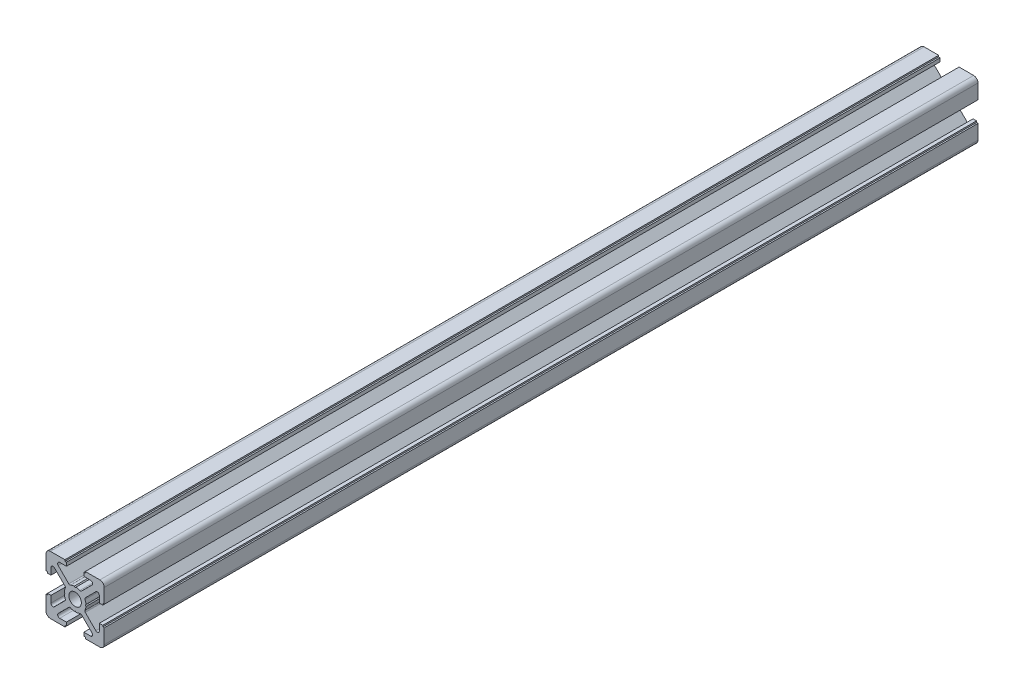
from build123d import *

# Parameters (mm, degrees)
SKETCH1_R           = 2.15
BOSS_EXTRUDE1_DEPTH = 300


with BuildPart() as part:
    # Sketch1 → Boss-Extrude1 (new body)
    with BuildSketch(Plane.XY.offset(308)):
        with BuildLine():
            Line((-3.499999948, -10), (-3.499999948, -9.5))
            Line((-3.499999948, -9.5), (-2.999999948, -9.5))
            Line((-2.999999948, -9.5), (-2.999999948, -8.299999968))
            Line((-2.999999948, -8.299999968), (-5.299390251, -8.299999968))
            ThreePointArc((-5.299390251, -8.299999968), (-5.946105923, -7.867878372), (-5.794365, -7.105025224))
            Line((-5.794365, -7.105025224), (-2.175465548, -3.48612574))
            ThreePointArc((-2.175465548, -3.48612574), (-1.907085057, -3.346986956), (-1.607569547, -3.387952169))
            ThreePointArc((-1.607569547, -3.387952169), (-0.96970891, -3.622452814), (-0.299999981, -3.73798071))
            Line((-0.299999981, -3.73798071), (1.9e-08, -3.449999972))
            Line((1.9e-08, -3.449999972), (0.300000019, -3.737980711))
            ThreePointArc((0.300000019, -3.737980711), (0.969708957, -3.622452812), (1.607569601, -3.387952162))
            ThreePointArc((1.607569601, -3.387952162), (1.90708511, -3.346986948), (2.175465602, -3.48612573))
            Line((2.175465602, -3.48612573), (5.794365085, -7.105025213))
            ThreePointArc((5.794365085, -7.105025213), (5.946106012, -7.867878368), (5.299390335, -8.299999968))
            Line((5.299390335, -8.299999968), (2.999999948, -8.299999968))
            Line((2.999999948, -8.299999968), (2.999999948, -9.5))
            Line((2.999999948, -9.5), (3.499999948, -9.5))
            Line((3.499999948, -9.5), (3.499999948, -10))
            Line((3.499999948, -10), (8.499999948, -10))
            ThreePointArc((8.499999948, -10), (9.56066012, -9.560660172), (9.999999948, -8.5))
            Line((9.999999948, -8.5), (9.999999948, -3.5))
            Line((9.999999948, -3.5), (9.499999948, -3.5))
            Line((9.499999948, -3.5), (9.499999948, -3))
            Line((9.499999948, -3), (8.299999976, -3))
            Line((8.299999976, -3), (8.299999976, -5.299390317))
            ThreePointArc((8.299999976, -5.299390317), (7.867878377, -5.94610599), (7.105025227, -5.794365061))
            Line((7.105025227, -5.794365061), (3.486125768, -2.17546557))
            ThreePointArc((3.486125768, -2.17546557), (3.346986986, -1.907085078), (3.387952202, -1.607569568))
            ThreePointArc((3.387952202, -1.607569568), (3.622452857, -0.969708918), (3.737980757, -0.299999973))
            Line((3.737980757, -0.299999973), (3.450000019, 2.8e-08))
            Line((3.450000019, 2.8e-08), (3.737980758, 0.300000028))
            ThreePointArc((3.737980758, 0.300000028), (3.622452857, 0.969708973), (3.387952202, 1.607569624))
            ThreePointArc((3.387952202, 1.607569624), (3.346986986, 1.907085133), (3.486125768, 2.175465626))
            Line((3.486125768, 2.175465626), (7.105025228, 5.794365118))
            ThreePointArc((7.105025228, 5.794365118), (7.867878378, 5.946106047), (8.299999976, 5.299390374))
            Line((8.299999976, 5.299390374), (8.299999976, 3))
            Line((8.299999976, 3), (9.499999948, 3))
            Line((9.499999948, 3), (9.499999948, 3.5))
            Line((9.499999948, 3.5), (9.999999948, 3.5))
            Line((9.999999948, 3.5), (9.999999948, 8.5))
            ThreePointArc((9.999999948, 8.5), (9.56066012, 9.560660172), (8.499999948, 10))
            Line((8.499999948, 10), (3.499999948, 10))
            Line((3.499999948, 10), (3.499999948, 9.5))
            Line((3.499999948, 9.5), (2.999999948, 9.5))
            Line((2.999999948, 9.5), (2.999999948, 8.300000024))
            Line((2.999999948, 8.300000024), (5.299390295, 8.300000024))
            ThreePointArc((5.299390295, 8.300000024), (5.946105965, 7.86787843), (5.794365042, 7.105025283))
            Line((5.794365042, 7.105025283), (2.175465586, 3.486125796))
            ThreePointArc((2.175465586, 3.486125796), (1.907085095, 3.346987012), (1.607569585, 3.387952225))
            ThreePointArc((1.607569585, 3.387952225), (0.969708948, 3.62245287), (0.300000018, 3.737980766))
            Line((0.300000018, 3.737980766), (1.9e-08, 3.450000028))
            Line((1.9e-08, 3.450000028), (-0.299999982, 3.737980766))
            ThreePointArc((-0.299999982, 3.737980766), (-0.969708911, 3.62245287), (-1.607569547, 3.387952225))
            ThreePointArc((-1.607569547, 3.387952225), (-1.907085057, 3.346987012), (-2.175465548, 3.486125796))
            Line((-2.175465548, 3.486125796), (-5.794365, 7.105025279))
            ThreePointArc((-5.794365, 7.105025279), (-5.946105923, 7.867878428), (-5.299390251, 8.300000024))
            Line((-5.299390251, 8.300000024), (-2.999999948, 8.300000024))
            Line((-2.999999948, 8.300000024), (-2.999999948, 9.5))
            Line((-2.999999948, 9.5), (-3.499999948, 9.5))
            Line((-3.499999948, 9.5), (-3.499999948, 10))
            Line((-3.499999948, 10), (-8.499999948, 10))
            ThreePointArc((-8.499999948, 10), (-9.56066012, 9.560660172), (-9.999999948, 8.5))
            Line((-9.999999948, 8.5), (-9.999999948, 3.5))
            Line((-9.999999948, 3.5), (-9.499999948, 3.5))
            Line((-9.499999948, 3.5), (-9.499999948, 3))
            Line((-9.499999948, 3), (-8.299999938, 3))
            Line((-8.299999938, 3), (-8.299999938, 5.299390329))
            ThreePointArc((-8.299999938, 5.299390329), (-7.867878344, 5.946105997), (-7.1050252, 5.794365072))
            Line((-7.1050252, 5.794365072), (-3.486125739, 2.175465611))
            ThreePointArc((-3.486125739, 2.175465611), (-3.346986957, 1.907085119), (-3.387952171, 1.607569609))
            ThreePointArc((-3.387952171, 1.607569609), (-3.622452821, 0.969708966), (-3.737980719, 0.300000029))
            Line((-3.737980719, 0.300000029), (-3.449999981, 2.8e-08))
            Line((-3.449999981, 2.8e-08), (-3.737980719, -0.299999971))
            ThreePointArc((-3.737980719, -0.299999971), (-3.622452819, -0.969708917), (-3.387952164, -1.607569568))
            ThreePointArc((-3.387952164, -1.607569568), (-3.346986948, -1.907085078), (-3.486125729, -2.17546557))
            Line((-3.486125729, -2.17546557), (-7.105025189, -5.794365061))
            ThreePointArc((-7.105025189, -5.794365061), (-7.867878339, -5.94610599), (-8.299999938, -5.299390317))
            Line((-8.299999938, -5.299390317), (-8.299999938, -3))
            Line((-8.299999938, -3), (-9.499999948, -3))
            Line((-9.499999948, -3), (-9.499999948, -3.5))
            Line((-9.499999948, -3.5), (-9.999999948, -3.5))
            Line((-9.999999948, -3.5), (-9.999999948, -8.5))
            ThreePointArc((-9.999999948, -8.5), (-9.56066012, -9.560660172), (-8.499999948, -10))
            Line((-8.499999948, -10), (-3.499999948, -10))
        make_face()
        with Locations(Location((1.9e-08, 2.8e-08, 0), (0, 0, 180))):
            Circle(SKETCH1_R, mode=Mode.SUBTRACT)
    extrude(amount=-BOSS_EXTRUDE1_DEPTH)


solid = part.part
